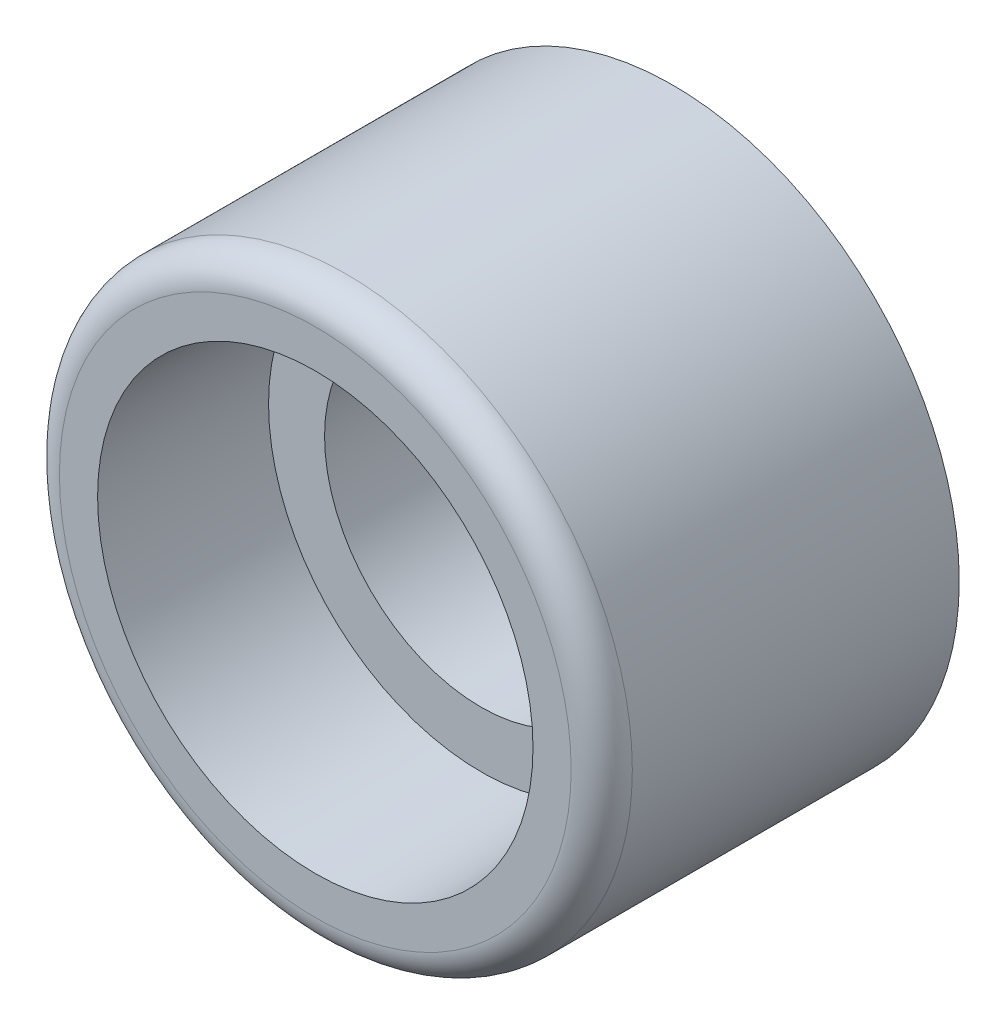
ISO-10303-21;
HEADER;
FILE_DESCRIPTION(('STEP AP214'),'2;1');
FILE_NAME('part.step','',(''),(''),'','','');
FILE_SCHEMA(('AUTOMOTIVE_DESIGN { 1 0 10303 214 1 1 1 1 }'));
ENDSEC;
DATA;
#1=APPLICATION_CONTEXT('core data for automotive mechanical design processes');
#2=APPLICATION_PROTOCOL_DEFINITION('international standard','automotive_design',2000,#1);
#3=PRODUCT_CONTEXT('',#1,'mechanical');
#4=PRODUCT('Part','Part','',(#3));
#5=PRODUCT_RELATED_PRODUCT_CATEGORY('part','',(#4));
#6=PRODUCT_DEFINITION_FORMATION('','',#4);
#7=PRODUCT_DEFINITION_CONTEXT('part definition',#1,'design');
#8=PRODUCT_DEFINITION('design','',#6,#7);
#9=PRODUCT_DEFINITION_SHAPE('','',#8);
#10=(LENGTH_UNIT() NAMED_UNIT(*) SI_UNIT(.MILLI.,.METRE.));
#11=(NAMED_UNIT(*) PLANE_ANGLE_UNIT() SI_UNIT($,.RADIAN.));
#12=(NAMED_UNIT(*) SI_UNIT($,.STERADIAN.) SOLID_ANGLE_UNIT());
#13=UNCERTAINTY_MEASURE_WITH_UNIT(LENGTH_MEASURE(1.E-05),#10,'distance_accuracy_value','');
#14=(GEOMETRIC_REPRESENTATION_CONTEXT(3) GLOBAL_UNCERTAINTY_ASSIGNED_CONTEXT((#13)) GLOBAL_UNIT_ASSIGNED_CONTEXT((#10,
#11,#12)) REPRESENTATION_CONTEXT('',''));
#15=CARTESIAN_POINT('',(0.,0.,0.));
#16=DIRECTION('',(0.,0.,1.));
#17=DIRECTION('',(1.,0.,0.));
#18=AXIS2_PLACEMENT_3D('',#15,#16,#17);
#19=CARTESIAN_POINT('',(0.,0.,19.812));
#20=DIRECTION('',(0.,0.,1.));
#21=DIRECTION('',(1.,0.,0.));
#22=AXIS2_PLACEMENT_3D('',#19,#20,#21);
#23=PLANE('',#22);
#24=CARTESIAN_POINT('',(0.,0.,19.812));
#25=DIRECTION('',(0.,0.,1.));
#26=DIRECTION('',(1.,0.,0.));
#27=AXIS2_PLACEMENT_3D('',#24,#25,#26);
#28=CIRCLE('',#27,28.36037);
#29=CARTESIAN_POINT('',(28.36037,0.,19.812));
#30=VERTEX_POINT('',#29);
#31=EDGE_CURVE('E39',#30,#30,#28,.T.);
#32=ORIENTED_EDGE('',*,*,#31,.T.);
#33=EDGE_LOOP('',(#32));
#34=FACE_BOUND('',#33,.T.);
#35=CARTESIAN_POINT('',(0.,0.,19.812));
#36=DIRECTION('',(0.,0.,-1.));
#37=DIRECTION('',(-1.,0.,0.));
#38=AXIS2_PLACEMENT_3D('',#35,#36,#37);
#39=CIRCLE('',#38,24.13);
#40=CARTESIAN_POINT('',(-24.13,0.,19.812));
#41=VERTEX_POINT('',#40);
#42=EDGE_CURVE('E58',#41,#41,#39,.T.);
#43=ORIENTED_EDGE('',*,*,#42,.T.);
#44=EDGE_LOOP('',(#43));
#45=FACE_BOUND('',#44,.T.);
#46=ADVANCED_FACE('F32',(#34,#45),#23,.T.);
#47=CARTESIAN_POINT('',(0.,0.,-19.812));
#48=DIRECTION('',(0.,0.,1.));
#49=DIRECTION('',(1.,0.,0.));
#50=AXIS2_PLACEMENT_3D('',#47,#48,#49);
#51=PLANE('',#50);
#52=CARTESIAN_POINT('',(0.,0.,-19.812));
#53=DIRECTION('',(0.,0.,1.));
#54=DIRECTION('',(1.,0.,0.));
#55=AXIS2_PLACEMENT_3D('',#52,#53,#54);
#56=CIRCLE('',#55,31.75);
#57=CARTESIAN_POINT('',(31.75,0.,-19.812));
#58=VERTEX_POINT('',#57);
#59=EDGE_CURVE('E43',#58,#58,#56,.T.);
#60=ORIENTED_EDGE('',*,*,#59,.F.);
#61=EDGE_LOOP('',(#60));
#62=FACE_BOUND('',#61,.T.);
#63=CARTESIAN_POINT('',(0.,0.,-19.812));
#64=DIRECTION('',(0.,0.,1.));
#65=DIRECTION('',(1.,0.,0.));
#66=AXIS2_PLACEMENT_3D('',#63,#64,#65);
#67=CIRCLE('',#66,17.35074);
#68=CARTESIAN_POINT('',(17.35074,0.,-19.812));
#69=VERTEX_POINT('',#68);
#70=EDGE_CURVE('E47',#69,#69,#67,.T.);
#71=ORIENTED_EDGE('',*,*,#70,.T.);
#72=EDGE_LOOP('',(#71));
#73=FACE_BOUND('',#72,.T.);
#74=ADVANCED_FACE('F81',(#62,#73),#51,.F.);
#75=CARTESIAN_POINT('',(0.,0.,19.812));
#76=DIRECTION('',(0.,0.,-1.));
#77=DIRECTION('',(-1.,0.,0.));
#78=AXIS2_PLACEMENT_3D('',#75,#76,#77);
#79=CYLINDRICAL_SURFACE('',#78,31.75);
#80=CARTESIAN_POINT('',(0.,0.,16.42237));
#81=DIRECTION('',(0.,0.,1.));
#82=DIRECTION('',(1.,0.,0.));
#83=AXIS2_PLACEMENT_3D('',#80,#81,#82);
#84=CIRCLE('',#83,31.75);
#85=CARTESIAN_POINT('',(31.75,0.,16.42237));
#86=VERTEX_POINT('',#85);
#87=EDGE_CURVE('E10',#86,#86,#84,.F.);
#88=ORIENTED_EDGE('',*,*,#87,.T.);
#89=EDGE_LOOP('',(#88));
#90=FACE_BOUND('',#89,.T.);
#91=ORIENTED_EDGE('',*,*,#59,.T.);
#92=EDGE_LOOP('',(#91));
#93=FACE_BOUND('',#92,.T.);
#94=ADVANCED_FACE('F77',(#90,#93),#79,.T.);
#95=CARTESIAN_POINT('',(0.,0.,68.8873036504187));
#96=DIRECTION('',(0.,0.,-1.));
#97=DIRECTION('',(-1.,0.,0.));
#98=AXIS2_PLACEMENT_3D('',#95,#96,#97);
#99=CYLINDRICAL_SURFACE('',#98,17.35074);
#100=CARTESIAN_POINT('',(0.,0.,1.43509999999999));
#101=DIRECTION('',(0.,0.,-1.));
#102=DIRECTION('',(-1.,0.,0.));
#103=AXIS2_PLACEMENT_3D('',#100,#101,#102);
#104=CIRCLE('',#103,17.35074);
#105=CARTESIAN_POINT('',(-17.35074,0.,1.43509999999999));
#106=VERTEX_POINT('',#105);
#107=EDGE_CURVE('E50',#106,#106,#104,.T.);
#108=ORIENTED_EDGE('',*,*,#107,.F.);
#109=EDGE_LOOP('',(#108));
#110=FACE_BOUND('',#109,.T.);
#111=ORIENTED_EDGE('',*,*,#70,.F.);
#112=EDGE_LOOP('',(#111));
#113=FACE_BOUND('',#112,.T.);
#114=ADVANCED_FACE('F71',(#110,#113),#99,.F.);
#115=CARTESIAN_POINT('',(0.,0.,1.4351));
#116=DIRECTION('',(0.,0.,-1.));
#117=DIRECTION('',(-1.,0.,0.));
#118=AXIS2_PLACEMENT_3D('',#115,#116,#117);
#119=PLANE('',#118);
#120=ORIENTED_EDGE('',*,*,#107,.T.);
#121=EDGE_LOOP('',(#120));
#122=FACE_BOUND('',#121,.T.);
#123=CARTESIAN_POINT('',(0.,0.,1.4351));
#124=DIRECTION('',(0.,0.,-1.));
#125=DIRECTION('',(-1.,0.,0.));
#126=AXIS2_PLACEMENT_3D('',#123,#124,#125);
#127=CIRCLE('',#126,23.5578335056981);
#128=CARTESIAN_POINT('',(-23.5578335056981,0.,1.4351));
#129=VERTEX_POINT('',#128);
#130=EDGE_CURVE('E52',#129,#129,#127,.T.);
#131=ORIENTED_EDGE('',*,*,#130,.F.);
#132=EDGE_LOOP('',(#131));
#133=FACE_BOUND('',#132,.T.);
#134=ADVANCED_FACE('F66',(#122,#133),#119,.F.);
#135=CARTESIAN_POINT('',(0.,0.,1.4351));
#136=DIRECTION('',(0.,0.,1.));
#137=DIRECTION('',(1.,0.,0.));
#138=AXIS2_PLACEMENT_3D('',#135,#136,#137);
#139=CONICAL_SURFACE('',#138,23.5578335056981,0.031125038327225);
#140=ORIENTED_EDGE('',*,*,#42,.F.);
#141=EDGE_LOOP('',(#140));
#142=FACE_BOUND('',#141,.T.);
#143=ORIENTED_EDGE('',*,*,#130,.T.);
#144=EDGE_LOOP('',(#143));
#145=FACE_BOUND('',#144,.T.);
#146=ADVANCED_FACE('F63',(#142,#145),#139,.F.);
#147=CARTESIAN_POINT('',(0.,0.,16.42237));
#148=DIRECTION('',(0.,0.,1.));
#149=DIRECTION('',(1.,0.,0.));
#150=AXIS2_PLACEMENT_3D('',#147,#148,#149);
#151=TOROIDAL_SURFACE('',#150,28.36037,3.38963);
#152=ORIENTED_EDGE('',*,*,#87,.F.);
#153=EDGE_LOOP('',(#152));
#154=FACE_BOUND('',#153,.T.);
#155=ORIENTED_EDGE('',*,*,#31,.F.);
#156=EDGE_LOOP('',(#155));
#157=FACE_BOUND('',#156,.T.);
#158=ADVANCED_FACE('F34',(#154,#157),#151,.T.);
#159=CLOSED_SHELL('',(#46,#74,#94,#114,#134,#146,#158));
#160=MANIFOLD_SOLID_BREP('B2',#159);
#161=ADVANCED_BREP_SHAPE_REPRESENTATION('',(#18,#160),#14);
#162=SHAPE_DEFINITION_REPRESENTATION(#9,#161);
ENDSEC;
END-ISO-10303-21;
